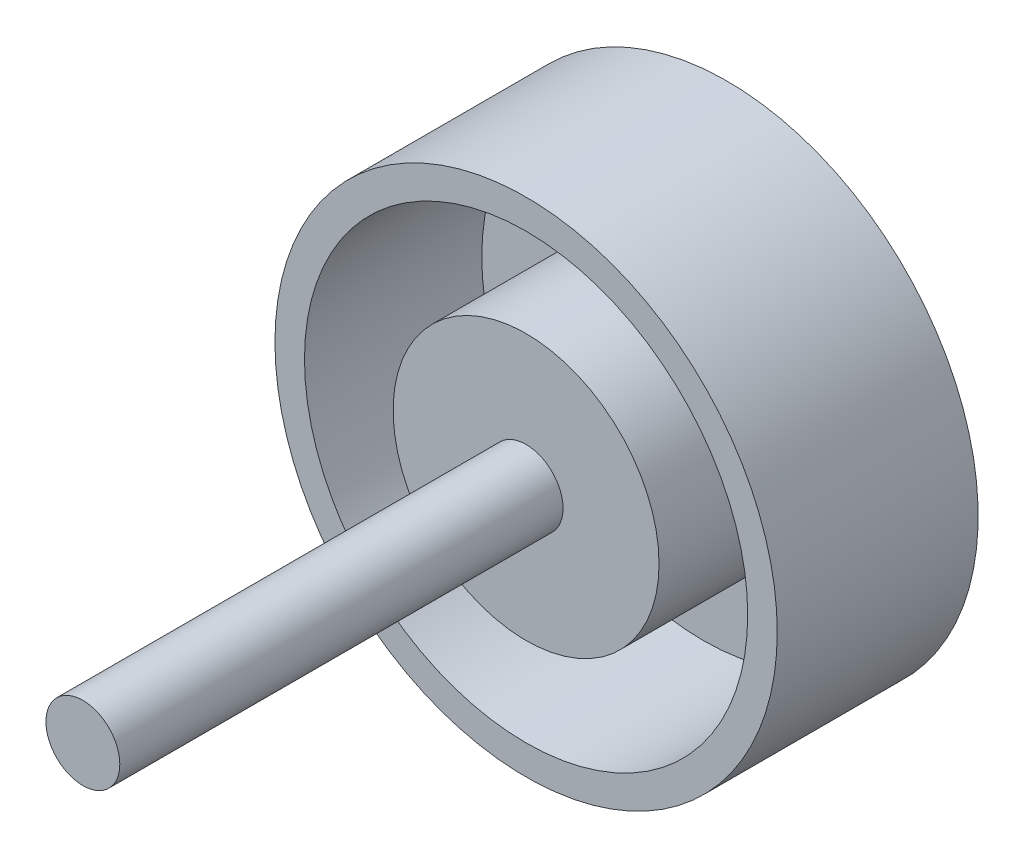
from build123d import *

# Parameters (mm, degrees)
ESQUISSE1_R             = 8.5
BASE_EXTRUSION_DEPTH    = 7
ESQUISSE2_R             = 7.5
ESQUISSE2_R_2           = 4.5
ENL_V_MAT_EXTRU_1_DEPTH = 6
ESQUISSE3_R             = 1.25
BOSS_EXTRU_1_DEPTH      = 15
ESQUISSE4_R             = 6
ENL_V_MAT_EXTRU_2_DEPTH = 0.5
ESQUISSE5_R             = 8.5
ESQUISSE5_R_2           = 7
ENL_V_MAT_EXTRU_3_DEPTH = 0.2


with BuildPart() as part:
    # Esquisse1 → Base-Extrusion (new body)
    with BuildSketch(Plane.XY):
        Circle(ESQUISSE1_R)
    extrude(amount=BASE_EXTRUSION_DEPTH)

    # Esquisse2 → Enl_v. mat.-Extru.1 (cut)
    with BuildSketch(Plane.XY.offset(7)):
        Circle(ESQUISSE2_R)
        Circle(ESQUISSE2_R_2, mode=Mode.SUBTRACT)
    extrude(amount=-ENL_V_MAT_EXTRU_1_DEPTH, mode=Mode.SUBTRACT)

    # Esquisse3 → Boss.-Extru.1 (add)
    with BuildSketch(Plane.XY.offset(7)):
        Circle(ESQUISSE3_R)
    extrude(amount=BOSS_EXTRU_1_DEPTH)

    # Esquisse4 → Enl_v. mat.-Extru.2 (cut)
    with BuildSketch(Plane(origin=(0, 0, 0), x_dir=(-1, 0, 0), z_dir=(0, 0, -1))):
        Circle(ESQUISSE4_R)
    extrude(amount=-ENL_V_MAT_EXTRU_2_DEPTH, mode=Mode.SUBTRACT)

    # Esquisse5 → Enl_v. mat.-Extru.3 (cut)
    with BuildSketch(Plane(origin=(0, 0, 0), x_dir=(-1, 0, 0), z_dir=(0, 0, -1))):
        Circle(ESQUISSE5_R)
        Circle(ESQUISSE5_R_2, mode=Mode.SUBTRACT)
    extrude(amount=-ENL_V_MAT_EXTRU_3_DEPTH, mode=Mode.SUBTRACT)


solid = part.part
